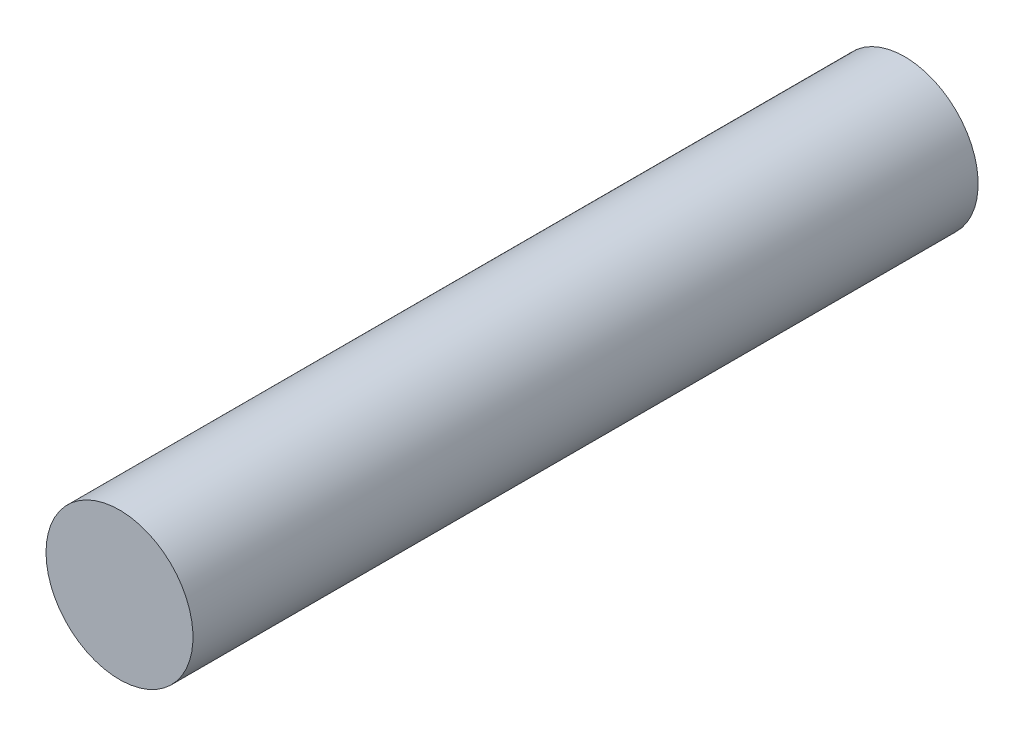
from build123d import *

# Parameters (mm, degrees)
SKETCH1_R           = 38
BOSS_EXTRUDE1_DEPTH = 203


with BuildPart() as part:
    # Sketch1 → Boss-Extrude1 (new, symmetric)
    with BuildSketch(Plane.XY):
        with Locations(Location((0, 0, 0), (0, 0, 180))):
            Circle(SKETCH1_R)
    extrude(amount=BOSS_EXTRUDE1_DEPTH, both=True)


solid = part.part
